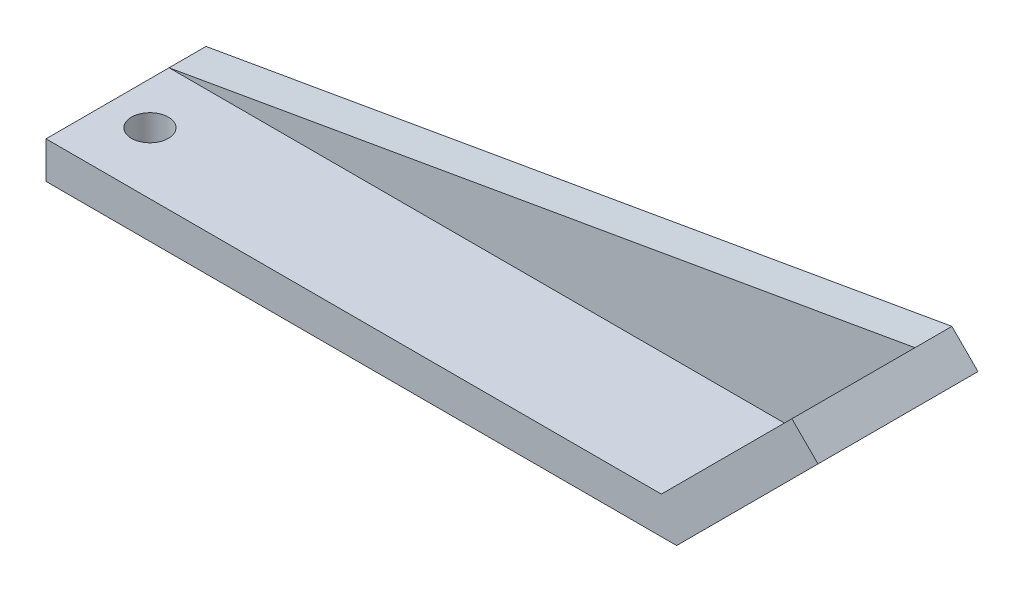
from build123d import *

# Parameters (mm, degrees)
EXTRUDE_1_DEPTH     = 10
EXTRUDE_2_DEPTH     = 3
SKETCH_4_R          = 1.5
CUT_EXTRUDE_2_DEPTH = 3
SKETCH_5_R          = 1.5
CUT_EXTRUDE_3_DEPTH = 30


with BuildPart() as part:
    # Sketch 1 → Extrude 1 (new body)
    with BuildSketch(Plane.XY):
        Polygon((0, 0), (10.606601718, 10.606601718), (12.727922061, 8.485281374), (1.242640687, -3), (-50, -3), (-50, 0), align=None)
    extrude(amount=EXTRUDE_1_DEPTH)

    # Sketch 3 → Extrude 2 (add)
    with BuildSketch(Plane(origin=(0, 0, 0), x_dir=(-1, 0, 0), z_dir=(0, 0, -1))):
        Polygon((-10.606601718, 10.606601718), (50, 0), (50, -3), (-1.242640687, -3), (-12.727922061, 8.485281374), align=None)
    extrude(amount=EXTRUDE_2_DEPTH)

    # Sketch 4 → Cut-Extrude 2 (cut)
    with BuildSketch(Plane(origin=(0, 0, 0), x_dir=(0, 0, 1), z_dir=(-0.7071067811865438, 0.7071067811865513, 0))):
        with Locations(Location((4.6, 7.8285, 0), (0, 0, 270))):
            Circle(SKETCH_4_R)
    extrude(amount=-CUT_EXTRUDE_2_DEPTH, mode=Mode.SUBTRACT)

    # Sketch 5 → Cut-Extrude 3 (cut)
    with BuildSketch(Plane(origin=(0, 0, 0), x_dir=(1, 0, 0), z_dir=(0, 1, 0))):
        with Locations(Location((-46.55735931, -5, 0), (0, 0, 180))):
            Circle(SKETCH_5_R)
    extrude(amount=-CUT_EXTRUDE_3_DEPTH, mode=Mode.SUBTRACT)


solid = part.part
